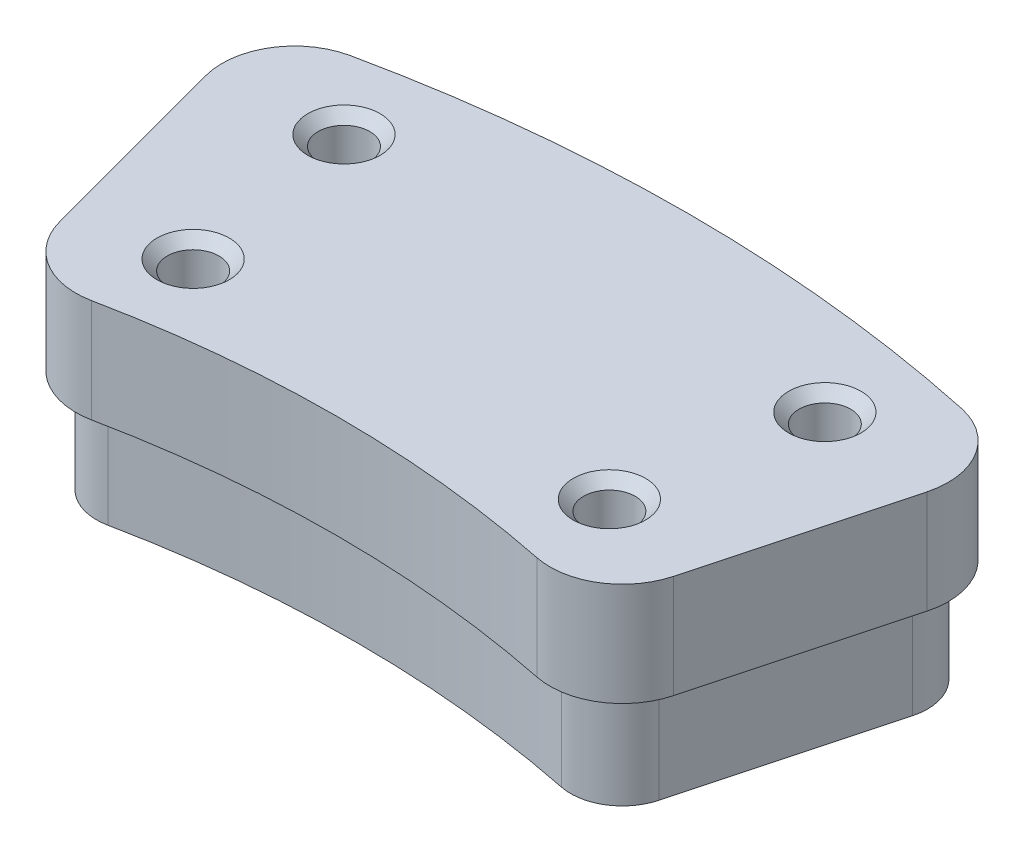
from build123d import *

# Parameters (mm, degrees)
BOSS_EXTRUDE1_DEPTH         = 20
M6_TAPPED_HOLE1_D           = 5
M6_TAPPED_HOLE1_CSINK_D     = 7
M6_TAPPED_HOLE1_CSINK_ANGLE = 90
SKETCH5_OUTSIDE_W           = 92.502
SKETCH5_OUTSIDE_H           = 56.678
CUT_EXTRUDE2_DEPTH          = 10
FILLET1_R                   = 5
FILLET2_R                   = 7


with BuildPart() as part:
    # Sketch1 → Boss-Extrude1 (new body)
    with BuildSketch(Plane(origin=(0, 0, 0), x_dir=(1, 0, 0), z_dir=(0, 1, 0))):
        with BuildLine():
            Line((-27.952456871, 104.319989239), (-36.752304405, 137.161467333))
            ThreePointArc((-36.752304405, 137.161467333), (0, 142), (36.752304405, 137.161467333))
            Line((36.752304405, 137.161467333), (27.952456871, 104.319989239))
            ThreePointArc((27.952456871, 104.319989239), (0, 108), (-27.952456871, 104.319989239))
        make_face()
    extrude(amount=BOSS_EXTRUDE1_DEPTH)

    # M6 Tapped Hole1 (through all)
    with Locations(Plane(origin=(0, 20, 0), x_dir=(-1, 0, 0), z_dir=(0, 1, 0))):
        with Locations((20.143188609, -114.237699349), (-20.143188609, -114.237699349), (-23.268855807, -131.964238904), (23.268855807, -131.964238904)):
            CounterSinkHole(M6_TAPPED_HOLE1_D / 2, M6_TAPPED_HOLE1_CSINK_D / 2, counter_sink_angle=M6_TAPPED_HOLE1_CSINK_ANGLE)

    # Sketch5 outside → Cut-Extrude2 (cut)
    with BuildSketch(Plane(origin=(0, 0, 0), x_dir=(1, 0, 0), z_dir=(0, 1, 0))):
        with Locations((0, 123.16)):
            Rectangle(SKETCH5_OUTSIDE_W, SKETCH5_OUTSIDE_H)
        with BuildLine():
            Line((-34.299117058, 135.733454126), (-26.533537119, 106.751915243))
            ThreePointArc((-26.533537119, 106.751915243), (0, 110), (26.533537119, 106.751915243))
            Line((26.533537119, 106.751915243), (34.299117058, 135.733454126))
            ThreePointArc((34.299117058, 135.733454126), (0, 140), (-34.299117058, 135.733454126))
        make_face(mode=Mode.SUBTRACT)
    extrude(amount=CUT_EXTRUDE2_DEPTH, mode=Mode.SUBTRACT)

    # Fillet1
    fillet1_edges = [part.edges().sort_by_distance(p)[0] for p in [
        (26.533537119, 5, -106.751915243),
        (34.299117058, 5, -135.733454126),
        (-34.299117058, 5, -135.733454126),
        (-26.533537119, 5, -106.751915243),
    ]]
    fillet(fillet1_edges, radius=FILLET1_R)

    # Fillet2
    fillet2_edges = [part.edges().sort_by_distance(p)[0] for p in [
        (-27.952456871, 15, -104.319989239),
        (-36.752304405, 15, -137.161467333),
        (36.752304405, 15, -137.161467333),
        (27.952456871, 15, -104.319989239),
    ]]
    fillet(fillet2_edges, radius=FILLET2_R)


solid = part.part
